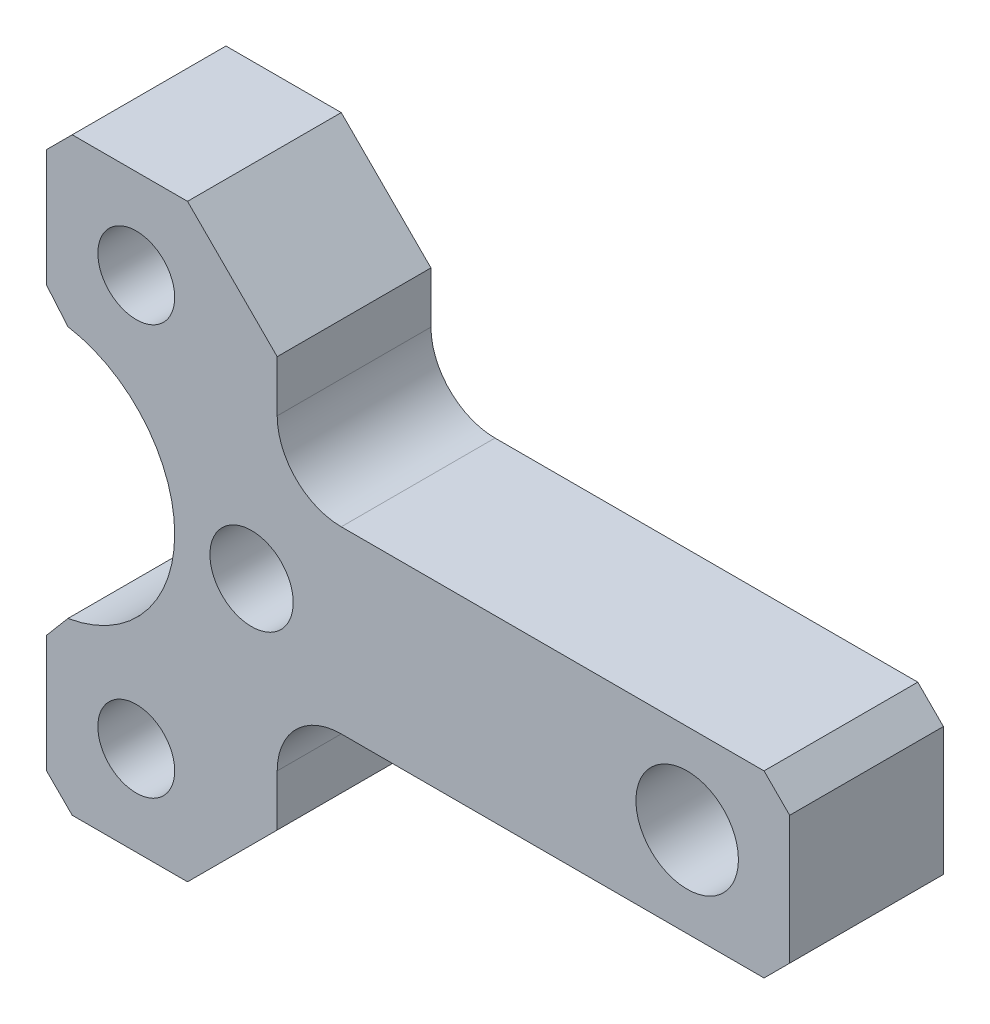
ISO-10303-21;
HEADER;
FILE_DESCRIPTION(('STEP AP214'),'2;1');
FILE_NAME('part.step','',(''),(''),'','','');
FILE_SCHEMA(('AUTOMOTIVE_DESIGN { 1 0 10303 214 1 1 1 1 }'));
ENDSEC;
DATA;
#1=APPLICATION_CONTEXT('core data for automotive mechanical design processes');
#2=APPLICATION_PROTOCOL_DEFINITION('international standard','automotive_design',2000,#1);
#3=PRODUCT_CONTEXT('',#1,'mechanical');
#4=PRODUCT('Part','Part','',(#3));
#5=PRODUCT_RELATED_PRODUCT_CATEGORY('part','',(#4));
#6=PRODUCT_DEFINITION_FORMATION('','',#4);
#7=PRODUCT_DEFINITION_CONTEXT('part definition',#1,'design');
#8=PRODUCT_DEFINITION('design','',#6,#7);
#9=PRODUCT_DEFINITION_SHAPE('','',#8);
#10=(LENGTH_UNIT() NAMED_UNIT(*) SI_UNIT(.MILLI.,.METRE.));
#11=(NAMED_UNIT(*) PLANE_ANGLE_UNIT() SI_UNIT($,.RADIAN.));
#12=(NAMED_UNIT(*) SI_UNIT($,.STERADIAN.) SOLID_ANGLE_UNIT());
#13=UNCERTAINTY_MEASURE_WITH_UNIT(LENGTH_MEASURE(1.E-05),#10,'distance_accuracy_value','');
#14=(GEOMETRIC_REPRESENTATION_CONTEXT(3) GLOBAL_UNCERTAINTY_ASSIGNED_CONTEXT((#13)) GLOBAL_UNIT_ASSIGNED_CONTEXT((#10,
#11,#12)) REPRESENTATION_CONTEXT('',''));
#15=CARTESIAN_POINT('',(0.,0.,0.));
#16=DIRECTION('',(0.,0.,1.));
#17=DIRECTION('',(1.,0.,0.));
#18=AXIS2_PLACEMENT_3D('',#15,#16,#17);
#19=CARTESIAN_POINT('',(23.,-12.,12.));
#20=DIRECTION('',(0.,0.,-1.));
#21=DIRECTION('',(-1.,0.,0.));
#22=AXIS2_PLACEMENT_3D('',#19,#20,#21);
#23=CYLINDRICAL_SURFACE('',#22,5.);
#24=CARTESIAN_POINT('',(23.,-12.,0.));
#25=DIRECTION('',(0.,0.,-1.));
#26=DIRECTION('',(-1.,0.,0.));
#27=AXIS2_PLACEMENT_3D('',#24,#25,#26);
#28=CIRCLE('',#27,5.);
#29=CARTESIAN_POINT('',(18.,-12.,0.));
#30=VERTEX_POINT('',#29);
#31=CARTESIAN_POINT('',(23.,-7.,0.));
#32=VERTEX_POINT('',#31);
#33=EDGE_CURVE('E176',#30,#32,#28,.T.);
#34=ORIENTED_EDGE('',*,*,#33,.T.);
#35=DIRECTION('',(0.,0.,-1.));
#36=VECTOR('',#35,1.);
#37=CARTESIAN_POINT('',(23.,-7.,12.));
#38=LINE('',#37,#36);
#39=CARTESIAN_POINT('',(23.,-7.,12.));
#40=VERTEX_POINT('',#39);
#41=EDGE_CURVE('E184',#40,#32,#38,.T.);
#42=ORIENTED_EDGE('',*,*,#41,.F.);
#43=CARTESIAN_POINT('',(23.,-12.,12.));
#44=DIRECTION('',(0.,0.,-1.));
#45=DIRECTION('',(-1.,0.,0.));
#46=AXIS2_PLACEMENT_3D('',#43,#44,#45);
#47=CIRCLE('',#46,5.);
#48=CARTESIAN_POINT('',(18.,-12.,12.));
#49=VERTEX_POINT('',#48);
#50=EDGE_CURVE('E228',#49,#40,#47,.T.);
#51=ORIENTED_EDGE('',*,*,#50,.F.);
#52=DIRECTION('',(0.,0.,-1.));
#53=VECTOR('',#52,1.);
#54=CARTESIAN_POINT('',(18.,-12.,12.));
#55=LINE('',#54,#53);
#56=EDGE_CURVE('E196',#49,#30,#55,.T.);
#57=ORIENTED_EDGE('',*,*,#56,.T.);
#58=EDGE_LOOP('',(#34,#42,#51,#57));
#59=FACE_BOUND('',#58,.T.);
#60=ADVANCED_FACE('F32',(#59),#23,.F.);
#61=CARTESIAN_POINT('',(23.,-7.,12.));
#62=DIRECTION('',(0.,1.,0.));
#63=DIRECTION('',(0.,0.,1.));
#64=AXIS2_PLACEMENT_3D('',#61,#62,#63);
#65=PLANE('',#64);
#66=DIRECTION('',(1.,0.,0.));
#67=VECTOR('',#66,1.);
#68=CARTESIAN_POINT('',(23.,-7.,0.));
#69=LINE('',#68,#67);
#70=CARTESIAN_POINT('',(56.,-7.,0.));
#71=VERTEX_POINT('',#70);
#72=EDGE_CURVE('E170',#32,#71,#69,.T.);
#73=ORIENTED_EDGE('',*,*,#72,.T.);
#74=DIRECTION('',(0.,0.,1.));
#75=VECTOR('',#74,1.);
#76=CARTESIAN_POINT('',(56.,-7.,12.));
#77=LINE('',#76,#75);
#78=CARTESIAN_POINT('',(56.,-7.,12.));
#79=VERTEX_POINT('',#78);
#80=EDGE_CURVE('E317',#71,#79,#77,.T.);
#81=ORIENTED_EDGE('',*,*,#80,.T.);
#82=DIRECTION('',(1.,0.,0.));
#83=VECTOR('',#82,1.);
#84=CARTESIAN_POINT('',(23.,-7.,12.));
#85=LINE('',#84,#83);
#86=EDGE_CURVE('E187',#40,#79,#85,.T.);
#87=ORIENTED_EDGE('',*,*,#86,.F.);
#88=ORIENTED_EDGE('',*,*,#41,.T.);
#89=EDGE_LOOP('',(#73,#81,#87,#88));
#90=FACE_BOUND('',#89,.T.);
#91=ADVANCED_FACE('F185',(#90),#65,.F.);
#92=CARTESIAN_POINT('',(58.,7.,12.));
#93=DIRECTION('',(-1.,0.,0.));
#94=DIRECTION('',(0.,0.,1.));
#95=AXIS2_PLACEMENT_3D('',#92,#93,#94);
#96=PLANE('',#95);
#97=DIRECTION('',(0.,1.,0.));
#98=VECTOR('',#97,1.);
#99=CARTESIAN_POINT('',(58.,7.,12.));
#100=LINE('',#99,#98);
#101=CARTESIAN_POINT('',(58.,-4.99999999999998,12.));
#102=VERTEX_POINT('',#101);
#103=CARTESIAN_POINT('',(58.,4.99999999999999,12.));
#104=VERTEX_POINT('',#103);
#105=EDGE_CURVE('E231',#102,#104,#100,.T.);
#106=ORIENTED_EDGE('',*,*,#105,.F.);
#107=DIRECTION('',(0.,0.,-1.));
#108=VECTOR('',#107,1.);
#109=CARTESIAN_POINT('',(58.,-4.99999999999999,12.));
#110=LINE('',#109,#108);
#111=CARTESIAN_POINT('',(58.,-4.99999999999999,0.));
#112=VERTEX_POINT('',#111);
#113=EDGE_CURVE('E314',#102,#112,#110,.T.);
#114=ORIENTED_EDGE('',*,*,#113,.T.);
#115=DIRECTION('',(0.,1.,0.));
#116=VECTOR('',#115,1.);
#117=CARTESIAN_POINT('',(58.,7.,0.));
#118=LINE('',#117,#116);
#119=CARTESIAN_POINT('',(58.,4.99999999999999,0.));
#120=VERTEX_POINT('',#119);
#121=EDGE_CURVE('E181',#112,#120,#118,.T.);
#122=ORIENTED_EDGE('',*,*,#121,.T.);
#123=DIRECTION('',(0.,0.,1.));
#124=VECTOR('',#123,1.);
#125=CARTESIAN_POINT('',(58.,4.99999999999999,12.));
#126=LINE('',#125,#124);
#127=EDGE_CURVE('E54',#120,#104,#126,.T.);
#128=ORIENTED_EDGE('',*,*,#127,.T.);
#129=EDGE_LOOP('',(#106,#114,#122,#128));
#130=FACE_BOUND('',#129,.T.);
#131=ADVANCED_FACE('F393',(#130),#96,.F.);
#132=CARTESIAN_POINT('',(23.,7.,12.));
#133=DIRECTION('',(0.,-1.,0.));
#134=DIRECTION('',(0.,0.,-1.));
#135=AXIS2_PLACEMENT_3D('',#132,#133,#134);
#136=PLANE('',#135);
#137=DIRECTION('',(-1.,0.,0.));
#138=VECTOR('',#137,1.);
#139=CARTESIAN_POINT('',(23.,7.,12.));
#140=LINE('',#139,#138);
#141=CARTESIAN_POINT('',(56.,7.,12.));
#142=VERTEX_POINT('',#141);
#143=CARTESIAN_POINT('',(23.,7.,12.));
#144=VERTEX_POINT('',#143);
#145=EDGE_CURVE('E233',#142,#144,#140,.T.);
#146=ORIENTED_EDGE('',*,*,#145,.F.);
#147=DIRECTION('',(0.,0.,-1.));
#148=VECTOR('',#147,1.);
#149=CARTESIAN_POINT('',(56.,7.,12.));
#150=LINE('',#149,#148);
#151=CARTESIAN_POINT('',(56.,7.,0.));
#152=VERTEX_POINT('',#151);
#153=EDGE_CURVE('E11',#142,#152,#150,.T.);
#154=ORIENTED_EDGE('',*,*,#153,.T.);
#155=DIRECTION('',(-1.,0.,0.));
#156=VECTOR('',#155,1.);
#157=CARTESIAN_POINT('',(23.,7.,0.));
#158=LINE('',#157,#156);
#159=CARTESIAN_POINT('',(23.,7.,0.));
#160=VERTEX_POINT('',#159);
#161=EDGE_CURVE('E205',#152,#160,#158,.T.);
#162=ORIENTED_EDGE('',*,*,#161,.T.);
#163=DIRECTION('',(0.,0.,-1.));
#164=VECTOR('',#163,1.);
#165=CARTESIAN_POINT('',(23.,7.,12.));
#166=LINE('',#165,#164);
#167=EDGE_CURVE('E192',#144,#160,#166,.T.);
#168=ORIENTED_EDGE('',*,*,#167,.F.);
#169=EDGE_LOOP('',(#146,#154,#162,#168));
#170=FACE_BOUND('',#169,.T.);
#171=ADVANCED_FACE('F397',(#170),#136,.F.);
#172=CARTESIAN_POINT('',(23.,12.,12.));
#173=DIRECTION('',(0.,0.,-1.));
#174=DIRECTION('',(-1.,0.,0.));
#175=AXIS2_PLACEMENT_3D('',#172,#173,#174);
#176=CYLINDRICAL_SURFACE('',#175,5.);
#177=CARTESIAN_POINT('',(23.,12.,0.));
#178=DIRECTION('',(0.,0.,-1.));
#179=DIRECTION('',(1.,0.,0.));
#180=AXIS2_PLACEMENT_3D('',#177,#178,#179);
#181=CIRCLE('',#180,5.);
#182=CARTESIAN_POINT('',(18.,12.,0.));
#183=VERTEX_POINT('',#182);
#184=EDGE_CURVE('E207',#160,#183,#181,.T.);
#185=ORIENTED_EDGE('',*,*,#184,.T.);
#186=DIRECTION('',(0.,0.,-1.));
#187=VECTOR('',#186,1.);
#188=CARTESIAN_POINT('',(18.,12.,12.));
#189=LINE('',#188,#187);
#190=CARTESIAN_POINT('',(18.,12.,12.));
#191=VERTEX_POINT('',#190);
#192=EDGE_CURVE('E257',#191,#183,#189,.T.);
#193=ORIENTED_EDGE('',*,*,#192,.F.);
#194=CARTESIAN_POINT('',(23.,12.,12.));
#195=DIRECTION('',(0.,0.,-1.));
#196=DIRECTION('',(1.,0.,0.));
#197=AXIS2_PLACEMENT_3D('',#194,#195,#196);
#198=CIRCLE('',#197,5.);
#199=EDGE_CURVE('E235',#144,#191,#198,.T.);
#200=ORIENTED_EDGE('',*,*,#199,.F.);
#201=ORIENTED_EDGE('',*,*,#167,.T.);
#202=EDGE_LOOP('',(#185,#193,#200,#201));
#203=FACE_BOUND('',#202,.T.);
#204=ADVANCED_FACE('F402',(#203),#176,.F.);
#205=CARTESIAN_POINT('',(18.,23.,12.));
#206=DIRECTION('',(-1.,0.,0.));
#207=DIRECTION('',(0.,-1.,0.));
#208=AXIS2_PLACEMENT_3D('',#205,#206,#207);
#209=PLANE('',#208);
#210=DIRECTION('',(0.,1.,0.));
#211=VECTOR('',#210,1.);
#212=CARTESIAN_POINT('',(18.,23.,0.));
#213=LINE('',#212,#211);
#214=CARTESIAN_POINT('',(18.,16.,0.));
#215=VERTEX_POINT('',#214);
#216=EDGE_CURVE('E209',#183,#215,#213,.T.);
#217=ORIENTED_EDGE('',*,*,#216,.T.);
#218=DIRECTION('',(0.,0.,1.));
#219=VECTOR('',#218,1.);
#220=CARTESIAN_POINT('',(18.,16.,12.));
#221=LINE('',#220,#219);
#222=CARTESIAN_POINT('',(18.,16.,12.));
#223=VERTEX_POINT('',#222);
#224=EDGE_CURVE('E269',#215,#223,#221,.T.);
#225=ORIENTED_EDGE('',*,*,#224,.T.);
#226=DIRECTION('',(0.,1.,0.));
#227=VECTOR('',#226,1.);
#228=CARTESIAN_POINT('',(18.,23.,12.));
#229=LINE('',#228,#227);
#230=EDGE_CURVE('E237',#191,#223,#229,.T.);
#231=ORIENTED_EDGE('',*,*,#230,.F.);
#232=ORIENTED_EDGE('',*,*,#192,.T.);
#233=EDGE_LOOP('',(#217,#225,#231,#232));
#234=FACE_BOUND('',#233,.T.);
#235=ADVANCED_FACE('F406',(#234),#209,.F.);
#236=CARTESIAN_POINT('',(0.,23.,12.));
#237=DIRECTION('',(0.,-1.,0.));
#238=DIRECTION('',(0.,0.,-1.));
#239=AXIS2_PLACEMENT_3D('',#236,#237,#238);
#240=PLANE('',#239);
#241=DIRECTION('',(-1.,0.,0.));
#242=VECTOR('',#241,1.);
#243=CARTESIAN_POINT('',(0.,23.,0.));
#244=LINE('',#243,#242);
#245=CARTESIAN_POINT('',(10.9999999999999,23.,0.));
#246=VERTEX_POINT('',#245);
#247=CARTESIAN_POINT('',(2.00000000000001,23.,0.));
#248=VERTEX_POINT('',#247);
#249=EDGE_CURVE('E212',#246,#248,#244,.T.);
#250=ORIENTED_EDGE('',*,*,#249,.T.);
#251=DIRECTION('',(0.,0.,1.));
#252=VECTOR('',#251,1.);
#253=CARTESIAN_POINT('',(2.00000000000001,23.,12.));
#254=LINE('',#253,#252);
#255=CARTESIAN_POINT('',(2.00000000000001,23.,12.));
#256=VERTEX_POINT('',#255);
#257=EDGE_CURVE('E39',#248,#256,#254,.T.);
#258=ORIENTED_EDGE('',*,*,#257,.T.);
#259=DIRECTION('',(-1.,0.,0.));
#260=VECTOR('',#259,1.);
#261=CARTESIAN_POINT('',(0.,23.,12.));
#262=LINE('',#261,#260);
#263=CARTESIAN_POINT('',(10.9999999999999,23.,12.));
#264=VERTEX_POINT('',#263);
#265=EDGE_CURVE('E240',#264,#256,#262,.T.);
#266=ORIENTED_EDGE('',*,*,#265,.F.);
#267=DIRECTION('',(0.,0.,-1.));
#268=VECTOR('',#267,1.);
#269=CARTESIAN_POINT('',(10.9999999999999,23.,12.));
#270=LINE('',#269,#268);
#271=EDGE_CURVE('E191',#264,#246,#270,.T.);
#272=ORIENTED_EDGE('',*,*,#271,.T.);
#273=EDGE_LOOP('',(#250,#258,#266,#272));
#274=FACE_BOUND('',#273,.T.);
#275=ADVANCED_FACE('F329',(#274),#240,.F.);
#276=CARTESIAN_POINT('',(0.,10.,12.));
#277=DIRECTION('',(1.,0.,0.));
#278=DIRECTION('',(0.,0.,-1.));
#279=AXIS2_PLACEMENT_3D('',#276,#277,#278);
#280=PLANE('',#279);
#281=DIRECTION('',(0.,-1.,0.));
#282=VECTOR('',#281,1.);
#283=CARTESIAN_POINT('',(0.,10.,0.));
#284=LINE('',#283,#282);
#285=CARTESIAN_POINT('',(0.,21.,0.));
#286=VERTEX_POINT('',#285);
#287=CARTESIAN_POINT('',(0.,11.8321595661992,0.));
#288=VERTEX_POINT('',#287);
#289=EDGE_CURVE('E215',#286,#288,#284,.T.);
#290=ORIENTED_EDGE('',*,*,#289,.T.);
#291=DIRECTION('',(0.,0.,1.));
#292=VECTOR('',#291,1.);
#293=CARTESIAN_POINT('',(0.,11.8321595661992,12.));
#294=LINE('',#293,#292);
#295=CARTESIAN_POINT('',(0.,11.8321595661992,12.));
#296=VERTEX_POINT('',#295);
#297=EDGE_CURVE('E300',#288,#296,#294,.T.);
#298=ORIENTED_EDGE('',*,*,#297,.T.);
#299=DIRECTION('',(0.,-1.,0.));
#300=VECTOR('',#299,1.);
#301=CARTESIAN_POINT('',(0.,10.,12.));
#302=LINE('',#301,#300);
#303=CARTESIAN_POINT('',(0.,21.,12.));
#304=VERTEX_POINT('',#303);
#305=EDGE_CURVE('E243',#304,#296,#302,.T.);
#306=ORIENTED_EDGE('',*,*,#305,.F.);
#307=DIRECTION('',(0.,0.,-1.));
#308=VECTOR('',#307,1.);
#309=CARTESIAN_POINT('',(0.,21.,12.));
#310=LINE('',#309,#308);
#311=EDGE_CURVE('E297',#304,#286,#310,.T.);
#312=ORIENTED_EDGE('',*,*,#311,.T.);
#313=EDGE_LOOP('',(#290,#298,#306,#312));
#314=FACE_BOUND('',#313,.T.);
#315=ADVANCED_FACE('F341',(#314),#280,.F.);
#316=CARTESIAN_POINT('',(0.,0.,12.));
#317=DIRECTION('',(0.,0.,-1.));
#318=DIRECTION('',(-1.,0.,0.));
#319=AXIS2_PLACEMENT_3D('',#316,#317,#318);
#320=CYLINDRICAL_SURFACE('',#319,10.);
#321=CARTESIAN_POINT('',(0.,0.,12.));
#322=DIRECTION('',(0.,0.,-1.));
#323=DIRECTION('',(1.,0.,0.));
#324=AXIS2_PLACEMENT_3D('',#321,#322,#323);
#325=CIRCLE('',#324,10.);
#326=CARTESIAN_POINT('',(1.66666666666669,9.86013297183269,12.));
#327=VERTEX_POINT('',#326);
#328=CARTESIAN_POINT('',(1.66666666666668,-9.86013297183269,12.));
#329=VERTEX_POINT('',#328);
#330=EDGE_CURVE('E246',#327,#329,#325,.T.);
#331=ORIENTED_EDGE('',*,*,#330,.F.);
#332=DIRECTION('',(0.,0.,-1.));
#333=VECTOR('',#332,1.);
#334=CARTESIAN_POINT('',(1.66666666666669,9.86013297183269,12.));
#335=LINE('',#334,#333);
#336=CARTESIAN_POINT('',(1.66666666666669,9.86013297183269,0.));
#337=VERTEX_POINT('',#336);
#338=EDGE_CURVE('E283',#327,#337,#335,.T.);
#339=ORIENTED_EDGE('',*,*,#338,.T.);
#340=CARTESIAN_POINT('',(0.,0.,0.));
#341=DIRECTION('',(0.,0.,-1.));
#342=DIRECTION('',(1.,0.,0.));
#343=AXIS2_PLACEMENT_3D('',#340,#341,#342);
#344=CIRCLE('',#343,10.);
#345=CARTESIAN_POINT('',(1.66666666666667,-9.86013297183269,0.));
#346=VERTEX_POINT('',#345);
#347=EDGE_CURVE('E218',#337,#346,#344,.T.);
#348=ORIENTED_EDGE('',*,*,#347,.T.);
#349=DIRECTION('',(0.,0.,-1.));
#350=VECTOR('',#349,1.);
#351=CARTESIAN_POINT('',(1.66666666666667,-9.86013297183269,12.));
#352=LINE('',#351,#350);
#353=EDGE_CURVE('E281',#346,#329,#352,.F.);
#354=ORIENTED_EDGE('',*,*,#353,.T.);
#355=EDGE_LOOP('',(#331,#339,#348,#354));
#356=FACE_BOUND('',#355,.T.);
#357=ADVANCED_FACE('F349',(#356),#320,.F.);
#358=CARTESIAN_POINT('',(0.,-23.,12.));
#359=DIRECTION('',(1.,0.,0.));
#360=DIRECTION('',(0.,0.,-1.));
#361=AXIS2_PLACEMENT_3D('',#358,#359,#360);
#362=PLANE('',#361);
#363=DIRECTION('',(0.,-1.,0.));
#364=VECTOR('',#363,1.);
#365=CARTESIAN_POINT('',(0.,-23.,12.));
#366=LINE('',#365,#364);
#367=CARTESIAN_POINT('',(0.,-11.8321595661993,12.));
#368=VERTEX_POINT('',#367);
#369=CARTESIAN_POINT('',(0.,-21.,12.));
#370=VERTEX_POINT('',#369);
#371=EDGE_CURVE('E249',#368,#370,#366,.T.);
#372=ORIENTED_EDGE('',*,*,#371,.F.);
#373=DIRECTION('',(0.,0.,-1.));
#374=VECTOR('',#373,1.);
#375=CARTESIAN_POINT('',(0.,-11.8321595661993,12.));
#376=LINE('',#375,#374);
#377=CARTESIAN_POINT('',(0.,-11.8321595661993,0.));
#378=VERTEX_POINT('',#377);
#379=EDGE_CURVE('E321',#368,#378,#376,.T.);
#380=ORIENTED_EDGE('',*,*,#379,.T.);
#381=DIRECTION('',(0.,-1.,0.));
#382=VECTOR('',#381,1.);
#383=CARTESIAN_POINT('',(0.,-23.,0.));
#384=LINE('',#383,#382);
#385=CARTESIAN_POINT('',(0.,-21.,0.));
#386=VERTEX_POINT('',#385);
#387=EDGE_CURVE('E221',#378,#386,#384,.T.);
#388=ORIENTED_EDGE('',*,*,#387,.T.);
#389=DIRECTION('',(0.,0.,1.));
#390=VECTOR('',#389,1.);
#391=CARTESIAN_POINT('',(0.,-21.,12.));
#392=LINE('',#391,#390);
#393=EDGE_CURVE('E319',#386,#370,#392,.T.);
#394=ORIENTED_EDGE('',*,*,#393,.T.);
#395=EDGE_LOOP('',(#372,#380,#388,#394));
#396=FACE_BOUND('',#395,.T.);
#397=ADVANCED_FACE('F358',(#396),#362,.F.);
#398=CARTESIAN_POINT('',(0.,-23.,12.));
#399=DIRECTION('',(0.,1.,0.));
#400=DIRECTION('',(0.,0.,1.));
#401=AXIS2_PLACEMENT_3D('',#398,#399,#400);
#402=PLANE('',#401);
#403=DIRECTION('',(1.,0.,0.));
#404=VECTOR('',#403,1.);
#405=CARTESIAN_POINT('',(0.,-23.,12.));
#406=LINE('',#405,#404);
#407=CARTESIAN_POINT('',(2.00000000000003,-23.,12.));
#408=VERTEX_POINT('',#407);
#409=CARTESIAN_POINT('',(10.9999999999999,-23.,12.));
#410=VERTEX_POINT('',#409);
#411=EDGE_CURVE('E252',#408,#410,#406,.T.);
#412=ORIENTED_EDGE('',*,*,#411,.F.);
#413=DIRECTION('',(0.,0.,-1.));
#414=VECTOR('',#413,1.);
#415=CARTESIAN_POINT('',(2.00000000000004,-23.,12.));
#416=LINE('',#415,#414);
#417=CARTESIAN_POINT('',(2.00000000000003,-23.,0.));
#418=VERTEX_POINT('',#417);
#419=EDGE_CURVE('E324',#408,#418,#416,.T.);
#420=ORIENTED_EDGE('',*,*,#419,.T.);
#421=DIRECTION('',(1.,0.,0.));
#422=VECTOR('',#421,1.);
#423=CARTESIAN_POINT('',(0.,-23.,0.));
#424=LINE('',#423,#422);
#425=CARTESIAN_POINT('',(10.9999999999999,-23.,0.));
#426=VERTEX_POINT('',#425);
#427=EDGE_CURVE('E224',#418,#426,#424,.T.);
#428=ORIENTED_EDGE('',*,*,#427,.T.);
#429=DIRECTION('',(0.,0.,1.));
#430=VECTOR('',#429,1.);
#431=CARTESIAN_POINT('',(10.9999999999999,-23.,12.));
#432=LINE('',#431,#430);
#433=EDGE_CURVE('E278',#426,#410,#432,.T.);
#434=ORIENTED_EDGE('',*,*,#433,.T.);
#435=EDGE_LOOP('',(#412,#420,#428,#434));
#436=FACE_BOUND('',#435,.T.);
#437=ADVANCED_FACE('F367',(#436),#402,.F.);
#438=CARTESIAN_POINT('',(18.,-23.,12.));
#439=DIRECTION('',(-1.,0.,0.));
#440=DIRECTION('',(0.,-1.,0.));
#441=AXIS2_PLACEMENT_3D('',#438,#439,#440);
#442=PLANE('',#441);
#443=DIRECTION('',(0.,1.,0.));
#444=VECTOR('',#443,1.);
#445=CARTESIAN_POINT('',(18.,-23.,12.));
#446=LINE('',#445,#444);
#447=CARTESIAN_POINT('',(18.,-15.9999999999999,12.));
#448=VERTEX_POINT('',#447);
#449=EDGE_CURVE('E254',#448,#49,#446,.T.);
#450=ORIENTED_EDGE('',*,*,#449,.F.);
#451=DIRECTION('',(0.,0.,-1.));
#452=VECTOR('',#451,1.);
#453=CARTESIAN_POINT('',(18.,-15.9999999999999,12.));
#454=LINE('',#453,#452);
#455=CARTESIAN_POINT('',(18.,-15.9999999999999,0.));
#456=VERTEX_POINT('',#455);
#457=EDGE_CURVE('E275',#448,#456,#454,.T.);
#458=ORIENTED_EDGE('',*,*,#457,.T.);
#459=DIRECTION('',(0.,1.,0.));
#460=VECTOR('',#459,1.);
#461=CARTESIAN_POINT('',(18.,-23.,0.));
#462=LINE('',#461,#460);
#463=EDGE_CURVE('E226',#456,#30,#462,.T.);
#464=ORIENTED_EDGE('',*,*,#463,.T.);
#465=ORIENTED_EDGE('',*,*,#56,.F.);
#466=EDGE_LOOP('',(#450,#458,#464,#465));
#467=FACE_BOUND('',#466,.T.);
#468=ADVANCED_FACE('F374',(#467),#442,.F.);
#469=CARTESIAN_POINT('',(23.,-12.,12.));
#470=DIRECTION('',(0.,0.,-1.));
#471=DIRECTION('',(-1.,0.,0.));
#472=AXIS2_PLACEMENT_3D('',#469,#470,#471);
#473=PLANE('',#472);
#474=CARTESIAN_POINT('',(16.,0.,12.));
#475=DIRECTION('',(0.,0.,1.));
#476=DIRECTION('',(1.,0.,0.));
#477=AXIS2_PLACEMENT_3D('',#474,#475,#476);
#478=CIRCLE('',#477,3.25);
#479=CARTESIAN_POINT('',(19.25,0.,12.));
#480=VERTEX_POINT('',#479);
#481=EDGE_CURVE('E457',#480,#480,#478,.T.);
#482=ORIENTED_EDGE('',*,*,#481,.F.);
#483=EDGE_LOOP('',(#482));
#484=FACE_BOUND('',#483,.T.);
#485=CARTESIAN_POINT('',(50.,0.,12.));
#486=DIRECTION('',(0.,0.,1.));
#487=DIRECTION('',(1.,0.,0.));
#488=AXIS2_PLACEMENT_3D('',#485,#486,#487);
#489=CIRCLE('',#488,4.00000000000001);
#490=CARTESIAN_POINT('',(54.,0.,12.));
#491=VERTEX_POINT('',#490);
#492=EDGE_CURVE('E453',#491,#491,#489,.T.);
#493=ORIENTED_EDGE('',*,*,#492,.F.);
#494=EDGE_LOOP('',(#493));
#495=FACE_BOUND('',#494,.T.);
#496=CARTESIAN_POINT('',(7.,-16.,12.));
#497=DIRECTION('',(0.,0.,1.));
#498=DIRECTION('',(1.,0.,0.));
#499=AXIS2_PLACEMENT_3D('',#496,#497,#498);
#500=CIRCLE('',#499,3.);
#501=CARTESIAN_POINT('',(10.,-16.,12.));
#502=VERTEX_POINT('',#501);
#503=EDGE_CURVE('E447',#502,#502,#500,.T.);
#504=ORIENTED_EDGE('',*,*,#503,.F.);
#505=EDGE_LOOP('',(#504));
#506=FACE_BOUND('',#505,.T.);
#507=CARTESIAN_POINT('',(7.,16.,12.));
#508=DIRECTION('',(0.,0.,1.));
#509=DIRECTION('',(1.,0.,0.));
#510=AXIS2_PLACEMENT_3D('',#507,#508,#509);
#511=CIRCLE('',#510,3.);
#512=CARTESIAN_POINT('',(10.,16.,12.));
#513=VERTEX_POINT('',#512);
#514=EDGE_CURVE('E200',#513,#513,#511,.T.);
#515=ORIENTED_EDGE('',*,*,#514,.F.);
#516=EDGE_LOOP('',(#515));
#517=FACE_BOUND('',#516,.T.);
#518=ORIENTED_EDGE('',*,*,#305,.T.);
#519=DIRECTION('',(-0.645497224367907,0.76376261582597,0.));
#520=VECTOR('',#519,1.);
#521=CARTESIAN_POINT('',(1.66666666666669,9.86013297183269,12.));
#522=LINE('',#521,#520);
#523=EDGE_CURVE('E311',#296,#327,#522,.F.);
#524=ORIENTED_EDGE('',*,*,#523,.T.);
#525=ORIENTED_EDGE('',*,*,#330,.T.);
#526=DIRECTION('',(0.645497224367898,0.763762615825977,0.));
#527=VECTOR('',#526,1.);
#528=CARTESIAN_POINT('',(0.,-11.8321595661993,12.));
#529=LINE('',#528,#527);
#530=EDGE_CURVE('E307',#329,#368,#529,.F.);
#531=ORIENTED_EDGE('',*,*,#530,.T.);
#532=ORIENTED_EDGE('',*,*,#371,.T.);
#533=DIRECTION('',(-0.707106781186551,0.707106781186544,0.));
#534=VECTOR('',#533,1.);
#535=CARTESIAN_POINT('',(2.00000000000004,-23.,12.));
#536=LINE('',#535,#534);
#537=EDGE_CURVE('E305',#370,#408,#536,.F.);
#538=ORIENTED_EDGE('',*,*,#537,.T.);
#539=ORIENTED_EDGE('',*,*,#411,.T.);
#540=DIRECTION('',(-0.707106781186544,-0.707106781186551,0.));
#541=VECTOR('',#540,1.);
#542=CARTESIAN_POINT('',(18.,-15.9999999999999,12.));
#543=LINE('',#542,#541);
#544=EDGE_CURVE('E271',#410,#448,#543,.F.);
#545=ORIENTED_EDGE('',*,*,#544,.T.);
#546=ORIENTED_EDGE('',*,*,#449,.T.);
#547=ORIENTED_EDGE('',*,*,#50,.T.);
#548=ORIENTED_EDGE('',*,*,#86,.T.);
#549=DIRECTION('',(-0.707106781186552,-0.707106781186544,0.));
#550=VECTOR('',#549,1.);
#551=CARTESIAN_POINT('',(58.,-4.99999999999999,12.));
#552=LINE('',#551,#550);
#553=EDGE_CURVE('E309',#79,#102,#552,.F.);
#554=ORIENTED_EDGE('',*,*,#553,.T.);
#555=ORIENTED_EDGE('',*,*,#105,.T.);
#556=DIRECTION('',(0.707106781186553,-0.707106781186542,0.));
#557=VECTOR('',#556,1.);
#558=CARTESIAN_POINT('',(56.,7.,12.));
#559=LINE('',#558,#557);
#560=EDGE_CURVE('E46',#104,#142,#559,.F.);
#561=ORIENTED_EDGE('',*,*,#560,.T.);
#562=ORIENTED_EDGE('',*,*,#145,.T.);
#563=ORIENTED_EDGE('',*,*,#199,.T.);
#564=ORIENTED_EDGE('',*,*,#230,.T.);
#565=DIRECTION('',(0.707106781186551,-0.707106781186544,0.));
#566=VECTOR('',#565,1.);
#567=CARTESIAN_POINT('',(10.9999999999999,23.,12.));
#568=LINE('',#567,#566);
#569=EDGE_CURVE('E273',#223,#264,#568,.F.);
#570=ORIENTED_EDGE('',*,*,#569,.T.);
#571=ORIENTED_EDGE('',*,*,#265,.T.);
#572=DIRECTION('',(0.707106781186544,0.707106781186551,0.));
#573=VECTOR('',#572,1.);
#574=CARTESIAN_POINT('',(0.,21.,12.));
#575=LINE('',#574,#573);
#576=EDGE_CURVE('E303',#256,#304,#575,.F.);
#577=ORIENTED_EDGE('',*,*,#576,.T.);
#578=EDGE_LOOP('',(#518,#524,#525,#531,#532,#538,#539,#545,#546,#547,#548,#554,#555,#561,#562,
#563,#564,#570,#571,#577));
#579=FACE_BOUND('',#578,.T.);
#580=ADVANCED_FACE('F334',(#484,#495,#506,#517,#579),#473,.F.);
#581=CARTESIAN_POINT('',(23.,-12.,0.));
#582=DIRECTION('',(0.,0.,-1.));
#583=DIRECTION('',(-1.,0.,0.));
#584=AXIS2_PLACEMENT_3D('',#581,#582,#583);
#585=PLANE('',#584);
#586=CARTESIAN_POINT('',(16.,0.,0.));
#587=DIRECTION('',(0.,0.,1.));
#588=DIRECTION('',(1.,0.,0.));
#589=AXIS2_PLACEMENT_3D('',#586,#587,#588);
#590=CIRCLE('',#589,3.25);
#591=CARTESIAN_POINT('',(19.25,0.,0.));
#592=VERTEX_POINT('',#591);
#593=EDGE_CURVE('E433',#592,#592,#590,.T.);
#594=ORIENTED_EDGE('',*,*,#593,.T.);
#595=EDGE_LOOP('',(#594));
#596=FACE_BOUND('',#595,.T.);
#597=CARTESIAN_POINT('',(50.,0.,0.));
#598=DIRECTION('',(0.,0.,1.));
#599=DIRECTION('',(1.,0.,0.));
#600=AXIS2_PLACEMENT_3D('',#597,#598,#599);
#601=CIRCLE('',#600,4.00000000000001);
#602=CARTESIAN_POINT('',(54.,0.,0.));
#603=VERTEX_POINT('',#602);
#604=EDGE_CURVE('E437',#603,#603,#601,.T.);
#605=ORIENTED_EDGE('',*,*,#604,.T.);
#606=EDGE_LOOP('',(#605));
#607=FACE_BOUND('',#606,.T.);
#608=CARTESIAN_POINT('',(7.,-16.,0.));
#609=DIRECTION('',(0.,0.,1.));
#610=DIRECTION('',(1.,0.,0.));
#611=AXIS2_PLACEMENT_3D('',#608,#609,#610);
#612=CIRCLE('',#611,3.);
#613=CARTESIAN_POINT('',(10.,-16.,0.));
#614=VERTEX_POINT('',#613);
#615=EDGE_CURVE('E441',#614,#614,#612,.T.);
#616=ORIENTED_EDGE('',*,*,#615,.T.);
#617=EDGE_LOOP('',(#616));
#618=FACE_BOUND('',#617,.T.);
#619=CARTESIAN_POINT('',(7.,16.,0.));
#620=DIRECTION('',(0.,0.,1.));
#621=DIRECTION('',(1.,0.,0.));
#622=AXIS2_PLACEMENT_3D('',#619,#620,#621);
#623=CIRCLE('',#622,3.);
#624=CARTESIAN_POINT('',(10.,16.,0.));
#625=VERTEX_POINT('',#624);
#626=EDGE_CURVE('E197',#625,#625,#623,.T.);
#627=ORIENTED_EDGE('',*,*,#626,.T.);
#628=EDGE_LOOP('',(#627));
#629=FACE_BOUND('',#628,.T.);
#630=ORIENTED_EDGE('',*,*,#347,.F.);
#631=DIRECTION('',(0.645497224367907,-0.76376261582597,0.));
#632=VECTOR('',#631,1.);
#633=CARTESIAN_POINT('',(21.3327464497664,-13.4090864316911,0.));
#634=LINE('',#633,#632);
#635=EDGE_CURVE('E295',#337,#288,#634,.F.);
#636=ORIENTED_EDGE('',*,*,#635,.T.);
#637=ORIENTED_EDGE('',*,*,#289,.F.);
#638=DIRECTION('',(-0.707106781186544,-0.707106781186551,0.));
#639=VECTOR('',#638,1.);
#640=CARTESIAN_POINT('',(-5.00000000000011,15.9999999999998,0.));
#641=LINE('',#640,#639);
#642=EDGE_CURVE('E288',#286,#248,#641,.F.);
#643=ORIENTED_EDGE('',*,*,#642,.T.);
#644=ORIENTED_EDGE('',*,*,#249,.F.);
#645=DIRECTION('',(-0.707106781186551,0.707106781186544,0.));
#646=VECTOR('',#645,1.);
#647=CARTESIAN_POINT('',(34.5,-0.499999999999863,0.));
#648=LINE('',#647,#646);
#649=EDGE_CURVE('E267',#246,#215,#648,.F.);
#650=ORIENTED_EDGE('',*,*,#649,.T.);
#651=ORIENTED_EDGE('',*,*,#216,.F.);
#652=ORIENTED_EDGE('',*,*,#184,.F.);
#653=ORIENTED_EDGE('',*,*,#161,.F.);
#654=DIRECTION('',(-0.707106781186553,0.707106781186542,0.));
#655=VECTOR('',#654,1.);
#656=CARTESIAN_POINT('',(48.9999999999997,14.0000000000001,0.));
#657=LINE('',#656,#655);
#658=EDGE_CURVE('E286',#152,#120,#657,.F.);
#659=ORIENTED_EDGE('',*,*,#658,.T.);
#660=ORIENTED_EDGE('',*,*,#121,.F.);
#661=DIRECTION('',(0.707106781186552,0.707106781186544,0.));
#662=VECTOR('',#661,1.);
#663=CARTESIAN_POINT('',(36.9999999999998,-26.,0.));
#664=LINE('',#663,#662);
#665=EDGE_CURVE('E178',#112,#71,#664,.F.);
#666=ORIENTED_EDGE('',*,*,#665,.T.);
#667=ORIENTED_EDGE('',*,*,#72,.F.);
#668=ORIENTED_EDGE('',*,*,#33,.F.);
#669=ORIENTED_EDGE('',*,*,#463,.F.);
#670=DIRECTION('',(0.707106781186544,0.707106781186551,0.));
#671=VECTOR('',#670,1.);
#672=CARTESIAN_POINT('',(22.4999999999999,-11.4999999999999,0.));
#673=LINE('',#672,#671);
#674=EDGE_CURVE('E264',#456,#426,#673,.F.);
#675=ORIENTED_EDGE('',*,*,#674,.T.);
#676=ORIENTED_EDGE('',*,*,#427,.F.);
#677=DIRECTION('',(0.707106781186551,-0.707106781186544,0.));
#678=VECTOR('',#677,1.);
#679=CARTESIAN_POINT('',(7.00000000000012,-28.,0.));
#680=LINE('',#679,#678);
#681=EDGE_CURVE('E290',#418,#386,#680,.F.);
#682=ORIENTED_EDGE('',*,*,#681,.T.);
#683=ORIENTED_EDGE('',*,*,#387,.F.);
#684=DIRECTION('',(-0.645497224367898,-0.763762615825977,0.));
#685=VECTOR('',#684,1.);
#686=CARTESIAN_POINT('',(9.50058688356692,-0.590913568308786,0.));
#687=LINE('',#686,#685);
#688=EDGE_CURVE('E292',#378,#346,#687,.F.);
#689=ORIENTED_EDGE('',*,*,#688,.T.);
#690=EDGE_LOOP('',(#630,#636,#637,#643,#644,#650,#651,#652,#653,#659,#660,#666,#667,#668,#669,
#675,#676,#682,#683,#689));
#691=FACE_BOUND('',#690,.T.);
#692=ADVANCED_FACE('F173',(#596,#607,#618,#629,#691),#585,.T.);
#693=CARTESIAN_POINT('',(10.9999999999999,23.,12.));
#694=DIRECTION('',(-0.707106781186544,-0.707106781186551,0.));
#695=DIRECTION('',(0.707106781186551,-0.707106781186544,0.));
#696=AXIS2_PLACEMENT_3D('',#693,#694,#695);
#697=PLANE('',#696);
#698=ORIENTED_EDGE('',*,*,#569,.F.);
#699=ORIENTED_EDGE('',*,*,#224,.F.);
#700=ORIENTED_EDGE('',*,*,#649,.F.);
#701=ORIENTED_EDGE('',*,*,#271,.F.);
#702=EDGE_LOOP('',(#698,#699,#700,#701));
#703=FACE_BOUND('',#702,.T.);
#704=ADVANCED_FACE('F378',(#703),#697,.F.);
#705=CARTESIAN_POINT('',(18.,-15.9999999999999,12.));
#706=DIRECTION('',(-0.707106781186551,0.707106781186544,0.));
#707=DIRECTION('',(-0.707106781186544,-0.707106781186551,0.));
#708=AXIS2_PLACEMENT_3D('',#705,#706,#707);
#709=PLANE('',#708);
#710=ORIENTED_EDGE('',*,*,#544,.F.);
#711=ORIENTED_EDGE('',*,*,#433,.F.);
#712=ORIENTED_EDGE('',*,*,#674,.F.);
#713=ORIENTED_EDGE('',*,*,#457,.F.);
#714=EDGE_LOOP('',(#710,#711,#712,#713));
#715=FACE_BOUND('',#714,.T.);
#716=ADVANCED_FACE('F375',(#715),#709,.F.);
#717=CARTESIAN_POINT('',(7.,16.,0.));
#718=DIRECTION('',(0.,0.,1.));
#719=DIRECTION('',(1.,0.,0.));
#720=AXIS2_PLACEMENT_3D('',#717,#718,#719);
#721=CYLINDRICAL_SURFACE('',#720,3.);
#722=ORIENTED_EDGE('',*,*,#626,.F.);
#723=EDGE_LOOP('',(#722));
#724=FACE_BOUND('',#723,.T.);
#725=ORIENTED_EDGE('',*,*,#514,.T.);
#726=EDGE_LOOP('',(#725));
#727=FACE_BOUND('',#726,.T.);
#728=ADVANCED_FACE('F377',(#724,#727),#721,.F.);
#729=CARTESIAN_POINT('',(7.,-16.,0.));
#730=DIRECTION('',(0.,0.,1.));
#731=DIRECTION('',(1.,0.,0.));
#732=AXIS2_PLACEMENT_3D('',#729,#730,#731);
#733=CYLINDRICAL_SURFACE('',#732,3.);
#734=ORIENTED_EDGE('',*,*,#615,.F.);
#735=EDGE_LOOP('',(#734));
#736=FACE_BOUND('',#735,.T.);
#737=ORIENTED_EDGE('',*,*,#503,.T.);
#738=EDGE_LOOP('',(#737));
#739=FACE_BOUND('',#738,.T.);
#740=ADVANCED_FACE('F384',(#736,#739),#733,.F.);
#741=CARTESIAN_POINT('',(50.,0.,0.));
#742=DIRECTION('',(0.,0.,1.));
#743=DIRECTION('',(1.,0.,0.));
#744=AXIS2_PLACEMENT_3D('',#741,#742,#743);
#745=CYLINDRICAL_SURFACE('',#744,4.00000000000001);
#746=ORIENTED_EDGE('',*,*,#604,.F.);
#747=EDGE_LOOP('',(#746));
#748=FACE_BOUND('',#747,.T.);
#749=ORIENTED_EDGE('',*,*,#492,.T.);
#750=EDGE_LOOP('',(#749));
#751=FACE_BOUND('',#750,.T.);
#752=ADVANCED_FACE('F468',(#748,#751),#745,.F.);
#753=CARTESIAN_POINT('',(16.,0.,0.));
#754=DIRECTION('',(0.,0.,1.));
#755=DIRECTION('',(1.,0.,0.));
#756=AXIS2_PLACEMENT_3D('',#753,#754,#755);
#757=CYLINDRICAL_SURFACE('',#756,3.25);
#758=ORIENTED_EDGE('',*,*,#593,.F.);
#759=EDGE_LOOP('',(#758));
#760=FACE_BOUND('',#759,.T.);
#761=ORIENTED_EDGE('',*,*,#481,.T.);
#762=EDGE_LOOP('',(#761));
#763=FACE_BOUND('',#762,.T.);
#764=ADVANCED_FACE('F461',(#760,#763),#757,.F.);
#765=CARTESIAN_POINT('',(1.66666666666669,9.86013297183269,12.));
#766=DIRECTION('',(0.76376261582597,0.645497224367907,0.));
#767=DIRECTION('',(-0.645497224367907,0.76376261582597,0.));
#768=AXIS2_PLACEMENT_3D('',#765,#766,#767);
#769=PLANE('',#768);
#770=ORIENTED_EDGE('',*,*,#523,.F.);
#771=ORIENTED_EDGE('',*,*,#297,.F.);
#772=ORIENTED_EDGE('',*,*,#635,.F.);
#773=ORIENTED_EDGE('',*,*,#338,.F.);
#774=EDGE_LOOP('',(#770,#771,#772,#773));
#775=FACE_BOUND('',#774,.T.);
#776=ADVANCED_FACE('F346',(#775),#769,.F.);
#777=CARTESIAN_POINT('',(58.,-4.99999999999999,12.));
#778=DIRECTION('',(-0.707106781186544,0.707106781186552,0.));
#779=DIRECTION('',(-0.707106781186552,-0.707106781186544,0.));
#780=AXIS2_PLACEMENT_3D('',#777,#778,#779);
#781=PLANE('',#780);
#782=ORIENTED_EDGE('',*,*,#553,.F.);
#783=ORIENTED_EDGE('',*,*,#80,.F.);
#784=ORIENTED_EDGE('',*,*,#665,.F.);
#785=ORIENTED_EDGE('',*,*,#113,.F.);
#786=EDGE_LOOP('',(#782,#783,#784,#785));
#787=FACE_BOUND('',#786,.T.);
#788=ADVANCED_FACE('F482',(#787),#781,.F.);
#789=CARTESIAN_POINT('',(0.,-11.8321595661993,12.));
#790=DIRECTION('',(0.763762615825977,-0.645497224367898,0.));
#791=DIRECTION('',(0.645497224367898,0.763762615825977,0.));
#792=AXIS2_PLACEMENT_3D('',#789,#790,#791);
#793=PLANE('',#792);
#794=ORIENTED_EDGE('',*,*,#530,.F.);
#795=ORIENTED_EDGE('',*,*,#353,.F.);
#796=ORIENTED_EDGE('',*,*,#688,.F.);
#797=ORIENTED_EDGE('',*,*,#379,.F.);
#798=EDGE_LOOP('',(#794,#795,#796,#797));
#799=FACE_BOUND('',#798,.T.);
#800=ADVANCED_FACE('F355',(#799),#793,.F.);
#801=CARTESIAN_POINT('',(2.00000000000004,-23.,12.));
#802=DIRECTION('',(0.707106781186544,0.707106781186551,0.));
#803=DIRECTION('',(-0.707106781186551,0.707106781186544,0.));
#804=AXIS2_PLACEMENT_3D('',#801,#802,#803);
#805=PLANE('',#804);
#806=ORIENTED_EDGE('',*,*,#537,.F.);
#807=ORIENTED_EDGE('',*,*,#393,.F.);
#808=ORIENTED_EDGE('',*,*,#681,.F.);
#809=ORIENTED_EDGE('',*,*,#419,.F.);
#810=EDGE_LOOP('',(#806,#807,#808,#809));
#811=FACE_BOUND('',#810,.T.);
#812=ADVANCED_FACE('F364',(#811),#805,.F.);
#813=CARTESIAN_POINT('',(0.,21.,12.));
#814=DIRECTION('',(0.707106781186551,-0.707106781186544,0.));
#815=DIRECTION('',(0.707106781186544,0.707106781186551,0.));
#816=AXIS2_PLACEMENT_3D('',#813,#814,#815);
#817=PLANE('',#816);
#818=ORIENTED_EDGE('',*,*,#576,.F.);
#819=ORIENTED_EDGE('',*,*,#257,.F.);
#820=ORIENTED_EDGE('',*,*,#642,.F.);
#821=ORIENTED_EDGE('',*,*,#311,.F.);
#822=EDGE_LOOP('',(#818,#819,#820,#821));
#823=FACE_BOUND('',#822,.T.);
#824=ADVANCED_FACE('F338',(#823),#817,.F.);
#825=CARTESIAN_POINT('',(56.,7.,12.));
#826=DIRECTION('',(-0.707106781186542,-0.707106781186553,0.));
#827=DIRECTION('',(0.707106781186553,-0.707106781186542,0.));
#828=AXIS2_PLACEMENT_3D('',#825,#826,#827);
#829=PLANE('',#828);
#830=ORIENTED_EDGE('',*,*,#560,.F.);
#831=ORIENTED_EDGE('',*,*,#127,.F.);
#832=ORIENTED_EDGE('',*,*,#658,.F.);
#833=ORIENTED_EDGE('',*,*,#153,.F.);
#834=EDGE_LOOP('',(#830,#831,#832,#833));
#835=FACE_BOUND('',#834,.T.);
#836=ADVANCED_FACE('F492',(#835),#829,.F.);
#837=CLOSED_SHELL('',(#60,#91,#131,#171,#204,#235,#275,#315,#357,#397,#437,#468,#580,#692,#704,
#716,#728,#740,#752,#764,#776,#788,#800,#812,#824,#836));
#838=MANIFOLD_SOLID_BREP('B2',#837);
#839=ADVANCED_BREP_SHAPE_REPRESENTATION('',(#18,#838),#14);
#840=SHAPE_DEFINITION_REPRESENTATION(#9,#839);
ENDSEC;
END-ISO-10303-21;
